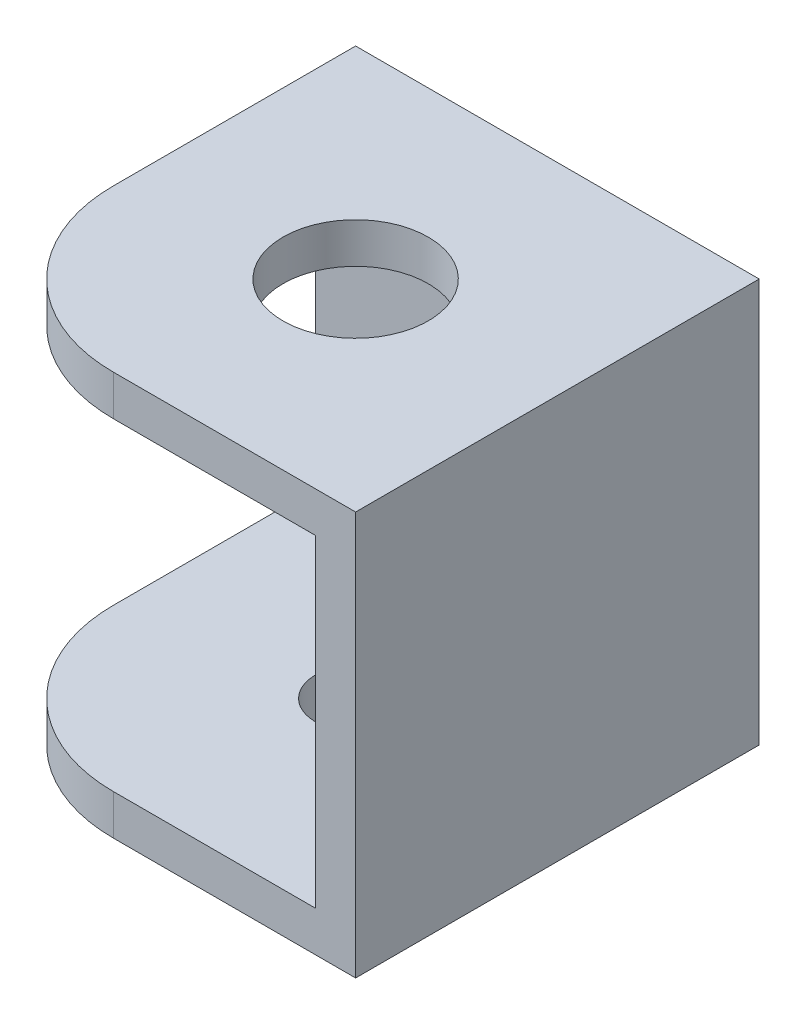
ISO-10303-21;
HEADER;
FILE_DESCRIPTION(('STEP AP214'),'2;1');
FILE_NAME('part.step','',(''),(''),'','','');
FILE_SCHEMA(('AUTOMOTIVE_DESIGN { 1 0 10303 214 1 1 1 1 }'));
ENDSEC;
DATA;
#1=APPLICATION_CONTEXT('core data for automotive mechanical design processes');
#2=APPLICATION_PROTOCOL_DEFINITION('international standard','automotive_design',2000,#1);
#3=PRODUCT_CONTEXT('',#1,'mechanical');
#4=PRODUCT('Part','Part','',(#3));
#5=PRODUCT_RELATED_PRODUCT_CATEGORY('part','',(#4));
#6=PRODUCT_DEFINITION_FORMATION('','',#4);
#7=PRODUCT_DEFINITION_CONTEXT('part definition',#1,'design');
#8=PRODUCT_DEFINITION('design','',#6,#7);
#9=PRODUCT_DEFINITION_SHAPE('','',#8);
#10=(LENGTH_UNIT() NAMED_UNIT(*) SI_UNIT(.MILLI.,.METRE.));
#11=(NAMED_UNIT(*) PLANE_ANGLE_UNIT() SI_UNIT($,.RADIAN.));
#12=(NAMED_UNIT(*) SI_UNIT($,.STERADIAN.) SOLID_ANGLE_UNIT());
#13=UNCERTAINTY_MEASURE_WITH_UNIT(LENGTH_MEASURE(1.E-05),#10,'distance_accuracy_value','');
#14=(GEOMETRIC_REPRESENTATION_CONTEXT(3) GLOBAL_UNCERTAINTY_ASSIGNED_CONTEXT((#13)) GLOBAL_UNIT_ASSIGNED_CONTEXT((#10,
#11,#12)) REPRESENTATION_CONTEXT('',''));
#15=CARTESIAN_POINT('',(0.,0.,0.));
#16=DIRECTION('',(0.,0.,1.));
#17=DIRECTION('',(1.,0.,0.));
#18=AXIS2_PLACEMENT_3D('',#15,#16,#17);
#19=CARTESIAN_POINT('',(-49.3691333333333,10.1681333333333,50.));
#20=DIRECTION('',(0.,1.,0.));
#21=DIRECTION('',(0.,0.,1.));
#22=AXIS2_PLACEMENT_3D('',#19,#20,#21);
#23=PLANE('',#22);
#24=CARTESIAN_POINT('',(-24.3691333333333,10.1681333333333,25.));
#25=DIRECTION('',(0.,1.,0.));
#26=DIRECTION('',(-1.,0.,0.));
#27=AXIS2_PLACEMENT_3D('',#24,#25,#26);
#28=CIRCLE('',#27,9.);
#29=CARTESIAN_POINT('',(-33.3691333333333,10.1681333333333,25.));
#30=VERTEX_POINT('',#29);
#31=EDGE_CURVE('E238',#30,#30,#28,.T.);
#32=ORIENTED_EDGE('',*,*,#31,.T.);
#33=EDGE_LOOP('',(#32));
#34=FACE_BOUND('',#33,.T.);
#35=DIRECTION('',(1.,0.,0.));
#36=VECTOR('',#35,1.);
#37=CARTESIAN_POINT('',(-4.36913333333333,10.1681333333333,5.));
#38=LINE('',#37,#36);
#39=CARTESIAN_POINT('',(-49.3691333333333,10.1681333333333,5.));
#40=VERTEX_POINT('',#39);
#41=CARTESIAN_POINT('',(-4.36913333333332,10.1681333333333,5.));
#42=VERTEX_POINT('',#41);
#43=EDGE_CURVE('E50',#40,#42,#38,.T.);
#44=ORIENTED_EDGE('',*,*,#43,.T.);
#45=DIRECTION('',(0.,0.,-1.));
#46=VECTOR('',#45,1.);
#47=CARTESIAN_POINT('',(-4.36913333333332,10.1681333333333,50.));
#48=LINE('',#47,#46);
#49=CARTESIAN_POINT('',(-4.36913333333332,10.1681333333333,50.));
#50=VERTEX_POINT('',#49);
#51=EDGE_CURVE('E117',#50,#42,#48,.T.);
#52=ORIENTED_EDGE('',*,*,#51,.F.);
#53=DIRECTION('',(1.,0.,0.));
#54=VECTOR('',#53,1.);
#55=CARTESIAN_POINT('',(-49.3691333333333,10.1681333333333,50.));
#56=LINE('',#55,#54);
#57=CARTESIAN_POINT('',(-29.3691333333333,10.1681333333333,50.));
#58=VERTEX_POINT('',#57);
#59=EDGE_CURVE('E106',#58,#50,#56,.T.);
#60=ORIENTED_EDGE('',*,*,#59,.F.);
#61=CARTESIAN_POINT('',(-29.3691333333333,10.1681333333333,30.));
#62=DIRECTION('',(0.,1.,0.));
#63=DIRECTION('',(0.,0.,1.));
#64=AXIS2_PLACEMENT_3D('',#61,#62,#63);
#65=CIRCLE('',#64,20.);
#66=CARTESIAN_POINT('',(-49.3691333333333,10.1681333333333,30.));
#67=VERTEX_POINT('',#66);
#68=EDGE_CURVE('E172',#58,#67,#65,.F.);
#69=ORIENTED_EDGE('',*,*,#68,.T.);
#70=DIRECTION('',(0.,0.,-1.));
#71=VECTOR('',#70,1.);
#72=CARTESIAN_POINT('',(-49.3691333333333,10.1681333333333,50.));
#73=LINE('',#72,#71);
#74=EDGE_CURVE('E46',#67,#40,#73,.T.);
#75=ORIENTED_EDGE('',*,*,#74,.T.);
#76=EDGE_LOOP('',(#44,#52,#60,#69,#75));
#77=FACE_BOUND('',#76,.T.);
#78=ADVANCED_FACE('F31',(#34,#77),#23,.F.);
#79=CARTESIAN_POINT('',(-4.36913333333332,10.1681333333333,50.));
#80=DIRECTION('',(1.,0.,0.));
#81=DIRECTION('',(0.,1.,0.));
#82=AXIS2_PLACEMENT_3D('',#79,#80,#81);
#83=PLANE('',#82);
#84=DIRECTION('',(0.,-1.,0.));
#85=VECTOR('',#84,1.);
#86=CARTESIAN_POINT('',(-4.36913333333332,-29.8318666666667,5.));
#87=LINE('',#86,#85);
#88=CARTESIAN_POINT('',(-4.36913333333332,-29.8318666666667,5.));
#89=VERTEX_POINT('',#88);
#90=EDGE_CURVE('E252',#42,#89,#87,.T.);
#91=ORIENTED_EDGE('',*,*,#90,.T.);
#92=DIRECTION('',(0.,0.,-1.));
#93=VECTOR('',#92,1.);
#94=CARTESIAN_POINT('',(-4.36913333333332,-29.8318666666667,50.));
#95=LINE('',#94,#93);
#96=CARTESIAN_POINT('',(-4.36913333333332,-29.8318666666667,50.));
#97=VERTEX_POINT('',#96);
#98=EDGE_CURVE('E120',#97,#89,#95,.T.);
#99=ORIENTED_EDGE('',*,*,#98,.F.);
#100=DIRECTION('',(0.,-1.,0.));
#101=VECTOR('',#100,1.);
#102=CARTESIAN_POINT('',(-4.36913333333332,10.1681333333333,50.));
#103=LINE('',#102,#101);
#104=EDGE_CURVE('E110',#50,#97,#103,.T.);
#105=ORIENTED_EDGE('',*,*,#104,.F.);
#106=ORIENTED_EDGE('',*,*,#51,.T.);
#107=EDGE_LOOP('',(#91,#99,#105,#106));
#108=FACE_BOUND('',#107,.T.);
#109=ADVANCED_FACE('F122',(#108),#83,.F.);
#110=CARTESIAN_POINT('',(-4.36913333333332,-29.8318666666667,50.));
#111=DIRECTION('',(0.,-1.,0.));
#112=DIRECTION('',(1.,0.,0.));
#113=AXIS2_PLACEMENT_3D('',#110,#111,#112);
#114=PLANE('',#113);
#115=CARTESIAN_POINT('',(-24.3691333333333,-29.8318666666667,25.));
#116=DIRECTION('',(0.,-1.,0.));
#117=DIRECTION('',(1.,0.,0.));
#118=AXIS2_PLACEMENT_3D('',#115,#116,#117);
#119=CIRCLE('',#118,5.);
#120=CARTESIAN_POINT('',(-19.3691333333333,-29.8318666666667,25.));
#121=VERTEX_POINT('',#120);
#122=EDGE_CURVE('E248',#121,#121,#119,.T.);
#123=ORIENTED_EDGE('',*,*,#122,.T.);
#124=EDGE_LOOP('',(#123));
#125=FACE_BOUND('',#124,.T.);
#126=DIRECTION('',(-1.,0.,0.));
#127=VECTOR('',#126,1.);
#128=CARTESIAN_POINT('',(-49.3691333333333,-29.8318666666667,5.));
#129=LINE('',#128,#127);
#130=CARTESIAN_POINT('',(-49.3691333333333,-29.8318666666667,5.));
#131=VERTEX_POINT('',#130);
#132=EDGE_CURVE('E254',#89,#131,#129,.T.);
#133=ORIENTED_EDGE('',*,*,#132,.T.);
#134=DIRECTION('',(0.,0.,-1.));
#135=VECTOR('',#134,1.);
#136=CARTESIAN_POINT('',(-49.3691333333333,-29.8318666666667,50.));
#137=LINE('',#136,#135);
#138=CARTESIAN_POINT('',(-49.3691333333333,-29.8318666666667,30.));
#139=VERTEX_POINT('',#138);
#140=EDGE_CURVE('E157',#139,#131,#137,.T.);
#141=ORIENTED_EDGE('',*,*,#140,.F.);
#142=CARTESIAN_POINT('',(-29.3691333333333,-29.8318666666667,30.));
#143=DIRECTION('',(0.,-1.,0.));
#144=DIRECTION('',(1.,0.,0.));
#145=AXIS2_PLACEMENT_3D('',#142,#143,#144);
#146=CIRCLE('',#145,20.);
#147=CARTESIAN_POINT('',(-29.3691333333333,-29.8318666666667,50.));
#148=VERTEX_POINT('',#147);
#149=EDGE_CURVE('E170',#139,#148,#146,.F.);
#150=ORIENTED_EDGE('',*,*,#149,.T.);
#151=DIRECTION('',(-1.,0.,0.));
#152=VECTOR('',#151,1.);
#153=CARTESIAN_POINT('',(-4.36913333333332,-29.8318666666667,50.));
#154=LINE('',#153,#152);
#155=EDGE_CURVE('E125',#97,#148,#154,.T.);
#156=ORIENTED_EDGE('',*,*,#155,.F.);
#157=ORIENTED_EDGE('',*,*,#98,.T.);
#158=EDGE_LOOP('',(#133,#141,#150,#156,#157));
#159=FACE_BOUND('',#158,.T.);
#160=ADVANCED_FACE('F203',(#125,#159),#114,.F.);
#161=CARTESIAN_POINT('',(-49.3691333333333,-29.8318666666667,50.));
#162=DIRECTION('',(1.,0.,0.));
#163=DIRECTION('',(0.,0.,-1.));
#164=AXIS2_PLACEMENT_3D('',#161,#162,#163);
#165=PLANE('',#164);
#166=DIRECTION('',(0.,0.,-1.));
#167=VECTOR('',#166,1.);
#168=CARTESIAN_POINT('',(-49.3691333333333,-34.8318666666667,50.));
#169=LINE('',#168,#167);
#170=CARTESIAN_POINT('',(-49.3691333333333,-34.8318666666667,30.));
#171=VERTEX_POINT('',#170);
#172=CARTESIAN_POINT('',(-49.3691333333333,-34.8318666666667,0.));
#173=VERTEX_POINT('',#172);
#174=EDGE_CURVE('E155',#171,#173,#169,.T.);
#175=ORIENTED_EDGE('',*,*,#174,.F.);
#176=DIRECTION('',(0.,-1.,0.));
#177=VECTOR('',#176,1.);
#178=CARTESIAN_POINT('',(-49.3691333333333,-29.8318666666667,30.));
#179=LINE('',#178,#177);
#180=EDGE_CURVE('E168',#171,#139,#179,.F.);
#181=ORIENTED_EDGE('',*,*,#180,.T.);
#182=ORIENTED_EDGE('',*,*,#140,.T.);
#183=DIRECTION('',(0.,1.,0.));
#184=VECTOR('',#183,1.);
#185=CARTESIAN_POINT('',(-49.3691333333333,10.1681333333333,5.));
#186=LINE('',#185,#184);
#187=EDGE_CURVE('E141',#131,#40,#186,.T.);
#188=ORIENTED_EDGE('',*,*,#187,.T.);
#189=ORIENTED_EDGE('',*,*,#74,.F.);
#190=DIRECTION('',(0.,-1.,0.));
#191=VECTOR('',#190,1.);
#192=CARTESIAN_POINT('',(-49.3691333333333,15.1681333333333,30.));
#193=LINE('',#192,#191);
#194=CARTESIAN_POINT('',(-49.3691333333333,15.1681333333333,30.));
#195=VERTEX_POINT('',#194);
#196=EDGE_CURVE('E39',#67,#195,#193,.F.);
#197=ORIENTED_EDGE('',*,*,#196,.T.);
#198=DIRECTION('',(0.,0.,-1.));
#199=VECTOR('',#198,1.);
#200=CARTESIAN_POINT('',(-49.3691333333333,15.1681333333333,50.));
#201=LINE('',#200,#199);
#202=CARTESIAN_POINT('',(-49.3691333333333,15.1681333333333,0.));
#203=VERTEX_POINT('',#202);
#204=EDGE_CURVE('E136',#195,#203,#201,.T.);
#205=ORIENTED_EDGE('',*,*,#204,.T.);
#206=DIRECTION('',(0.,-1.,0.));
#207=VECTOR('',#206,1.);
#208=CARTESIAN_POINT('',(-49.3691333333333,-29.8318666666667,0.));
#209=LINE('',#208,#207);
#210=EDGE_CURVE('E137',#203,#173,#209,.T.);
#211=ORIENTED_EDGE('',*,*,#210,.T.);
#212=EDGE_LOOP('',(#175,#181,#182,#188,#189,#197,#205,#211));
#213=FACE_BOUND('',#212,.T.);
#214=ADVANCED_FACE('F177',(#213),#165,.F.);
#215=CARTESIAN_POINT('',(-49.3691333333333,-34.8318666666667,50.));
#216=DIRECTION('',(0.,1.,0.));
#217=DIRECTION('',(0.,0.,1.));
#218=AXIS2_PLACEMENT_3D('',#215,#216,#217);
#219=PLANE('',#218);
#220=CARTESIAN_POINT('',(-24.3691333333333,-34.8318666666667,25.));
#221=DIRECTION('',(0.,-1.,0.));
#222=DIRECTION('',(0.,0.,-1.));
#223=AXIS2_PLACEMENT_3D('',#220,#221,#222);
#224=CIRCLE('',#223,5.);
#225=CARTESIAN_POINT('',(-24.3691333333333,-34.8318666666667,20.));
#226=VERTEX_POINT('',#225);
#227=EDGE_CURVE('E243',#226,#226,#224,.T.);
#228=ORIENTED_EDGE('',*,*,#227,.F.);
#229=EDGE_LOOP('',(#228));
#230=FACE_BOUND('',#229,.T.);
#231=DIRECTION('',(1.,0.,0.));
#232=VECTOR('',#231,1.);
#233=CARTESIAN_POINT('',(-49.3691333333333,-34.8318666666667,50.));
#234=LINE('',#233,#232);
#235=CARTESIAN_POINT('',(-29.3691333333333,-34.8318666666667,50.));
#236=VERTEX_POINT('',#235);
#237=CARTESIAN_POINT('',(0.630866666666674,-34.8318666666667,50.));
#238=VERTEX_POINT('',#237);
#239=EDGE_CURVE('E127',#236,#238,#234,.T.);
#240=ORIENTED_EDGE('',*,*,#239,.F.);
#241=CARTESIAN_POINT('',(-29.3691333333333,-34.8318666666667,30.));
#242=DIRECTION('',(0.,1.,0.));
#243=DIRECTION('',(0.,0.,1.));
#244=AXIS2_PLACEMENT_3D('',#241,#242,#243);
#245=CIRCLE('',#244,20.);
#246=EDGE_CURVE('E166',#236,#171,#245,.F.);
#247=ORIENTED_EDGE('',*,*,#246,.T.);
#248=ORIENTED_EDGE('',*,*,#174,.T.);
#249=DIRECTION('',(1.,0.,0.));
#250=VECTOR('',#249,1.);
#251=CARTESIAN_POINT('',(-49.3691333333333,-34.8318666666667,0.));
#252=LINE('',#251,#250);
#253=CARTESIAN_POINT('',(0.630866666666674,-34.8318666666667,0.));
#254=VERTEX_POINT('',#253);
#255=EDGE_CURVE('E140',#173,#254,#252,.T.);
#256=ORIENTED_EDGE('',*,*,#255,.T.);
#257=DIRECTION('',(0.,0.,-1.));
#258=VECTOR('',#257,1.);
#259=CARTESIAN_POINT('',(0.630866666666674,-34.8318666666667,50.));
#260=LINE('',#259,#258);
#261=EDGE_CURVE('E152',#238,#254,#260,.T.);
#262=ORIENTED_EDGE('',*,*,#261,.F.);
#263=EDGE_LOOP('',(#240,#247,#248,#256,#262));
#264=FACE_BOUND('',#263,.T.);
#265=ADVANCED_FACE('F212',(#230,#264),#219,.F.);
#266=CARTESIAN_POINT('',(0.630866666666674,-34.8318666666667,50.));
#267=DIRECTION('',(-1.,0.,0.));
#268=DIRECTION('',(0.,0.,1.));
#269=AXIS2_PLACEMENT_3D('',#266,#267,#268);
#270=PLANE('',#269);
#271=DIRECTION('',(0.,1.,0.));
#272=VECTOR('',#271,1.);
#273=CARTESIAN_POINT('',(0.630866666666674,-34.8318666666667,0.));
#274=LINE('',#273,#272);
#275=CARTESIAN_POINT('',(0.630866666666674,15.1681333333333,0.));
#276=VERTEX_POINT('',#275);
#277=EDGE_CURVE('E143',#254,#276,#274,.T.);
#278=ORIENTED_EDGE('',*,*,#277,.T.);
#279=DIRECTION('',(0.,0.,-1.));
#280=VECTOR('',#279,1.);
#281=CARTESIAN_POINT('',(0.630866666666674,15.1681333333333,50.));
#282=LINE('',#281,#280);
#283=CARTESIAN_POINT('',(0.630866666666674,15.1681333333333,50.));
#284=VERTEX_POINT('',#283);
#285=EDGE_CURVE('E149',#284,#276,#282,.T.);
#286=ORIENTED_EDGE('',*,*,#285,.F.);
#287=DIRECTION('',(0.,1.,0.));
#288=VECTOR('',#287,1.);
#289=CARTESIAN_POINT('',(0.630866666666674,-34.8318666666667,50.));
#290=LINE('',#289,#288);
#291=EDGE_CURVE('E132',#238,#284,#290,.T.);
#292=ORIENTED_EDGE('',*,*,#291,.F.);
#293=ORIENTED_EDGE('',*,*,#261,.T.);
#294=EDGE_LOOP('',(#278,#286,#292,#293));
#295=FACE_BOUND('',#294,.T.);
#296=ADVANCED_FACE('F215',(#295),#270,.F.);
#297=CARTESIAN_POINT('',(0.630866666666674,15.1681333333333,50.));
#298=DIRECTION('',(0.,-1.,0.));
#299=DIRECTION('',(1.,0.,0.));
#300=AXIS2_PLACEMENT_3D('',#297,#298,#299);
#301=PLANE('',#300);
#302=CARTESIAN_POINT('',(-24.3691333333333,15.1681333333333,25.));
#303=DIRECTION('',(0.,1.,0.));
#304=DIRECTION('',(-1.,0.,0.));
#305=AXIS2_PLACEMENT_3D('',#302,#303,#304);
#306=CIRCLE('',#305,9.);
#307=CARTESIAN_POINT('',(-33.3691333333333,15.1681333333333,25.));
#308=VERTEX_POINT('',#307);
#309=EDGE_CURVE('E241',#308,#308,#306,.T.);
#310=ORIENTED_EDGE('',*,*,#309,.F.);
#311=EDGE_LOOP('',(#310));
#312=FACE_BOUND('',#311,.T.);
#313=ORIENTED_EDGE('',*,*,#204,.F.);
#314=CARTESIAN_POINT('',(-29.3691333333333,15.1681333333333,30.));
#315=DIRECTION('',(0.,-1.,0.));
#316=DIRECTION('',(1.,0.,0.));
#317=AXIS2_PLACEMENT_3D('',#314,#315,#316);
#318=CIRCLE('',#317,20.);
#319=CARTESIAN_POINT('',(-29.3691333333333,15.1681333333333,50.));
#320=VERTEX_POINT('',#319);
#321=EDGE_CURVE('E11',#195,#320,#318,.F.);
#322=ORIENTED_EDGE('',*,*,#321,.T.);
#323=DIRECTION('',(-1.,0.,0.));
#324=VECTOR('',#323,1.);
#325=CARTESIAN_POINT('',(0.630866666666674,15.1681333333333,50.));
#326=LINE('',#325,#324);
#327=EDGE_CURVE('E134',#284,#320,#326,.T.);
#328=ORIENTED_EDGE('',*,*,#327,.F.);
#329=ORIENTED_EDGE('',*,*,#285,.T.);
#330=DIRECTION('',(-1.,0.,0.));
#331=VECTOR('',#330,1.);
#332=CARTESIAN_POINT('',(0.630866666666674,15.1681333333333,0.));
#333=LINE('',#332,#331);
#334=EDGE_CURVE('E115',#276,#203,#333,.T.);
#335=ORIENTED_EDGE('',*,*,#334,.T.);
#336=EDGE_LOOP('',(#313,#322,#328,#329,#335));
#337=FACE_BOUND('',#336,.T.);
#338=ADVANCED_FACE('F182',(#312,#337),#301,.F.);
#339=CARTESIAN_POINT('',(-49.3691333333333,15.1681333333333,50.));
#340=DIRECTION('',(0.,0.,-1.));
#341=DIRECTION('',(-1.,0.,0.));
#342=AXIS2_PLACEMENT_3D('',#339,#340,#341);
#343=PLANE('',#342);
#344=ORIENTED_EDGE('',*,*,#155,.T.);
#345=DIRECTION('',(0.,-1.,0.));
#346=VECTOR('',#345,1.);
#347=CARTESIAN_POINT('',(-29.3691333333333,15.1681333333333,50.));
#348=LINE('',#347,#346);
#349=EDGE_CURVE('E163',#148,#236,#348,.T.);
#350=ORIENTED_EDGE('',*,*,#349,.T.);
#351=ORIENTED_EDGE('',*,*,#239,.T.);
#352=ORIENTED_EDGE('',*,*,#291,.T.);
#353=ORIENTED_EDGE('',*,*,#327,.T.);
#354=DIRECTION('',(0.,-1.,0.));
#355=VECTOR('',#354,1.);
#356=CARTESIAN_POINT('',(-29.3691333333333,15.1681333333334,50.));
#357=LINE('',#356,#355);
#358=EDGE_CURVE('E114',#320,#58,#357,.T.);
#359=ORIENTED_EDGE('',*,*,#358,.T.);
#360=ORIENTED_EDGE('',*,*,#59,.T.);
#361=ORIENTED_EDGE('',*,*,#104,.T.);
#362=EDGE_LOOP('',(#344,#350,#351,#352,#353,#359,#360,#361));
#363=FACE_BOUND('',#362,.T.);
#364=ADVANCED_FACE('F108',(#363),#343,.F.);
#365=CARTESIAN_POINT('',(-49.3691333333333,15.1681333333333,0.));
#366=DIRECTION('',(0.,0.,-1.));
#367=DIRECTION('',(-1.,0.,0.));
#368=AXIS2_PLACEMENT_3D('',#365,#366,#367);
#369=PLANE('',#368);
#370=ORIENTED_EDGE('',*,*,#210,.F.);
#371=ORIENTED_EDGE('',*,*,#334,.F.);
#372=ORIENTED_EDGE('',*,*,#277,.F.);
#373=ORIENTED_EDGE('',*,*,#255,.F.);
#374=EDGE_LOOP('',(#370,#371,#372,#373));
#375=FACE_BOUND('',#374,.T.);
#376=ADVANCED_FACE('F195',(#375),#369,.T.);
#377=CARTESIAN_POINT('',(-29.3691333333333,15.1681333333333,30.));
#378=DIRECTION('',(0.,-1.,0.));
#379=DIRECTION('',(0.,0.,-1.));
#380=AXIS2_PLACEMENT_3D('',#377,#378,#379);
#381=CYLINDRICAL_SURFACE('',#380,20.);
#382=ORIENTED_EDGE('',*,*,#149,.F.);
#383=ORIENTED_EDGE('',*,*,#180,.F.);
#384=ORIENTED_EDGE('',*,*,#246,.F.);
#385=ORIENTED_EDGE('',*,*,#349,.F.);
#386=EDGE_LOOP('',(#382,#383,#384,#385));
#387=FACE_BOUND('',#386,.T.);
#388=ADVANCED_FACE('F187',(#387),#381,.T.);
#389=CARTESIAN_POINT('',(-29.3691333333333,15.1681333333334,30.));
#390=DIRECTION('',(0.,-1.,0.));
#391=DIRECTION('',(1.,0.,0.));
#392=AXIS2_PLACEMENT_3D('',#389,#390,#391);
#393=CYLINDRICAL_SURFACE('',#392,20.);
#394=ORIENTED_EDGE('',*,*,#321,.F.);
#395=ORIENTED_EDGE('',*,*,#196,.F.);
#396=ORIENTED_EDGE('',*,*,#68,.F.);
#397=ORIENTED_EDGE('',*,*,#358,.F.);
#398=EDGE_LOOP('',(#394,#395,#396,#397));
#399=FACE_BOUND('',#398,.T.);
#400=ADVANCED_FACE('F33',(#399),#393,.T.);
#401=CARTESIAN_POINT('',(-4.36913333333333,10.1681333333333,5.));
#402=DIRECTION('',(0.,0.,-1.));
#403=DIRECTION('',(-1.,0.,0.));
#404=AXIS2_PLACEMENT_3D('',#401,#402,#403);
#405=PLANE('',#404);
#406=ORIENTED_EDGE('',*,*,#43,.F.);
#407=ORIENTED_EDGE('',*,*,#187,.F.);
#408=ORIENTED_EDGE('',*,*,#132,.F.);
#409=ORIENTED_EDGE('',*,*,#90,.F.);
#410=EDGE_LOOP('',(#406,#407,#408,#409));
#411=FACE_BOUND('',#410,.T.);
#412=ADVANCED_FACE('F186',(#411),#405,.F.);
#413=CARTESIAN_POINT('',(-24.3691333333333,15.1681333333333,25.));
#414=DIRECTION('',(0.,-1.,0.));
#415=DIRECTION('',(0.,0.,-1.));
#416=AXIS2_PLACEMENT_3D('',#413,#414,#415);
#417=CYLINDRICAL_SURFACE('',#416,5.);
#418=ORIENTED_EDGE('',*,*,#227,.T.);
#419=EDGE_LOOP('',(#418));
#420=FACE_BOUND('',#419,.T.);
#421=ORIENTED_EDGE('',*,*,#122,.F.);
#422=EDGE_LOOP('',(#421));
#423=FACE_BOUND('',#422,.T.);
#424=ADVANCED_FACE('F192',(#420,#423),#417,.F.);
#425=CARTESIAN_POINT('',(-24.3691333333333,10.1681333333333,25.));
#426=DIRECTION('',(0.,1.,0.));
#427=DIRECTION('',(-1.,0.,0.));
#428=AXIS2_PLACEMENT_3D('',#425,#426,#427);
#429=CYLINDRICAL_SURFACE('',#428,9.);
#430=ORIENTED_EDGE('',*,*,#31,.F.);
#431=EDGE_LOOP('',(#430));
#432=FACE_BOUND('',#431,.T.);
#433=ORIENTED_EDGE('',*,*,#309,.T.);
#434=EDGE_LOOP('',(#433));
#435=FACE_BOUND('',#434,.T.);
#436=ADVANCED_FACE('F230',(#432,#435),#429,.F.);
#437=CLOSED_SHELL('',(#78,#109,#160,#214,#265,#296,#338,#364,#376,#388,#400,#412,#424,#436));
#438=MANIFOLD_SOLID_BREP('B2',#437);
#439=ADVANCED_BREP_SHAPE_REPRESENTATION('',(#18,#438),#14);
#440=SHAPE_DEFINITION_REPRESENTATION(#9,#439);
ENDSEC;
END-ISO-10303-21;
